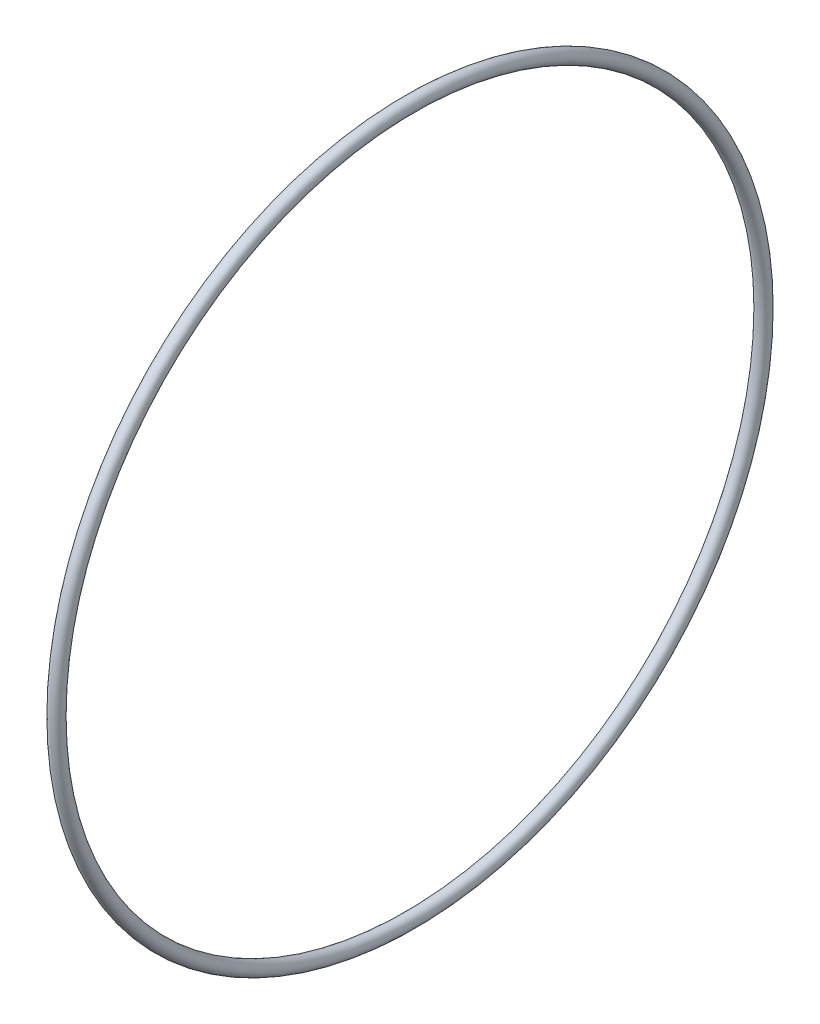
ISO-10303-21;
HEADER;
FILE_DESCRIPTION(('STEP AP214'),'2;1');
FILE_NAME('part.step','',(''),(''),'','','');
FILE_SCHEMA(('AUTOMOTIVE_DESIGN { 1 0 10303 214 1 1 1 1 }'));
ENDSEC;
DATA;
#1=APPLICATION_CONTEXT('core data for automotive mechanical design processes');
#2=APPLICATION_PROTOCOL_DEFINITION('international standard','automotive_design',2000,#1);
#3=PRODUCT_CONTEXT('',#1,'mechanical');
#4=PRODUCT('Part','Part','',(#3));
#5=PRODUCT_RELATED_PRODUCT_CATEGORY('part','',(#4));
#6=PRODUCT_DEFINITION_FORMATION('','',#4);
#7=PRODUCT_DEFINITION_CONTEXT('part definition',#1,'design');
#8=PRODUCT_DEFINITION('design','',#6,#7);
#9=PRODUCT_DEFINITION_SHAPE('','',#8);
#10=(LENGTH_UNIT() NAMED_UNIT(*) SI_UNIT(.MILLI.,.METRE.));
#11=(NAMED_UNIT(*) PLANE_ANGLE_UNIT() SI_UNIT($,.RADIAN.));
#12=(NAMED_UNIT(*) SI_UNIT($,.STERADIAN.) SOLID_ANGLE_UNIT());
#13=UNCERTAINTY_MEASURE_WITH_UNIT(LENGTH_MEASURE(1.E-05),#10,'distance_accuracy_value','');
#14=(GEOMETRIC_REPRESENTATION_CONTEXT(3) GLOBAL_UNCERTAINTY_ASSIGNED_CONTEXT((#13)) GLOBAL_UNIT_ASSIGNED_CONTEXT((#10,
#11,#12)) REPRESENTATION_CONTEXT('',''));
#15=CARTESIAN_POINT('',(0.,0.,0.));
#16=DIRECTION('',(0.,0.,1.));
#17=DIRECTION('',(1.,0.,0.));
#18=AXIS2_PLACEMENT_3D('',#15,#16,#17);
#19=CARTESIAN_POINT('',(0.,0.,0.));
#20=DIRECTION('',(1.,0.,0.));
#21=DIRECTION('',(0.,0.,-1.));
#22=AXIS2_PLACEMENT_3D('',#19,#20,#21);
#23=TOROIDAL_SURFACE('',#22,91.5924,1.7653);
#24=CARTESIAN_POINT('',(0.,0.,-93.3577));
#25=VERTEX_POINT('',#24);
#26=VERTEX_LOOP('',#25);
#27=FACE_BOUND('',#26,.T.);
#28=ADVANCED_FACE('F28',(#27),#23,.T.);
#29=CLOSED_SHELL('',(#28));
#30=MANIFOLD_SOLID_BREP('B2',#29);
#31=ADVANCED_BREP_SHAPE_REPRESENTATION('',(#18,#30),#14);
#32=SHAPE_DEFINITION_REPRESENTATION(#9,#31);
ENDSEC;
END-ISO-10303-21;
